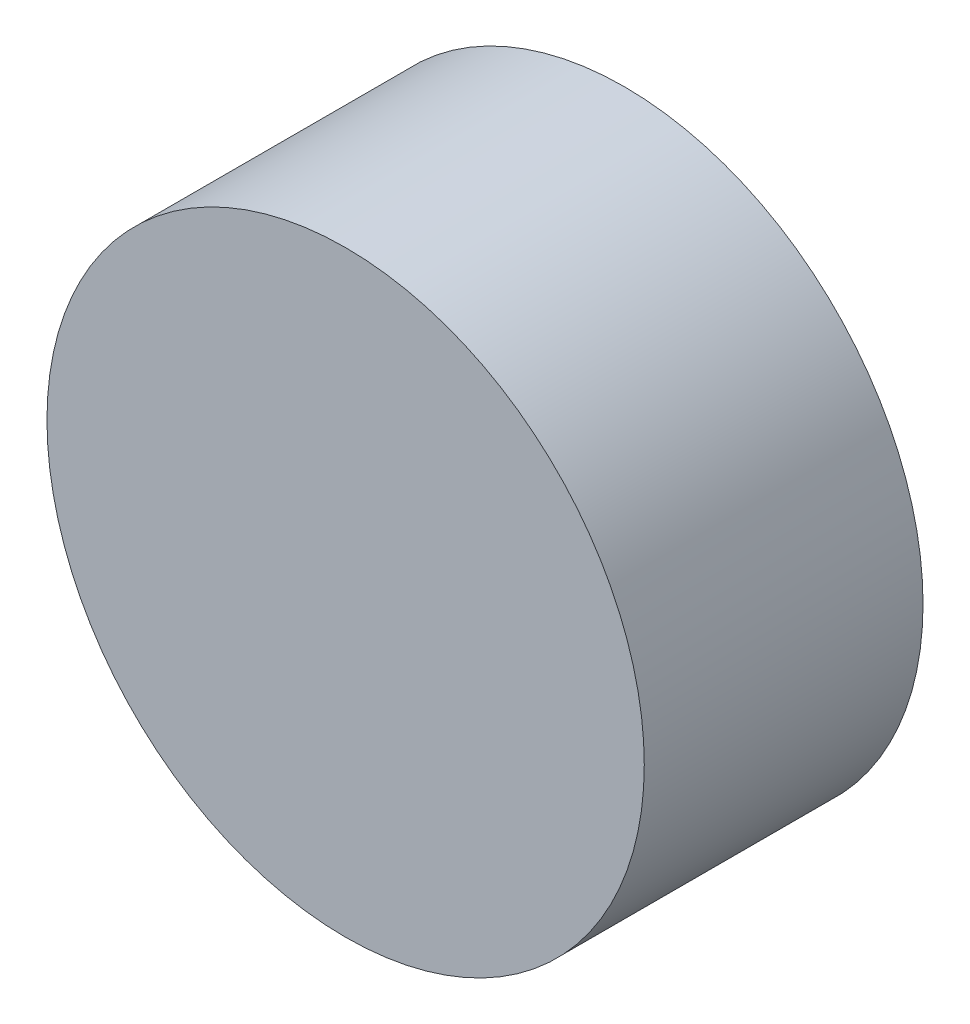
ISO-10303-21;
HEADER;
FILE_DESCRIPTION(('STEP AP214'),'2;1');
FILE_NAME('part.step','',(''),(''),'','','');
FILE_SCHEMA(('AUTOMOTIVE_DESIGN { 1 0 10303 214 1 1 1 1 }'));
ENDSEC;
DATA;
#1=APPLICATION_CONTEXT('core data for automotive mechanical design processes');
#2=APPLICATION_PROTOCOL_DEFINITION('international standard','automotive_design',2000,#1);
#3=PRODUCT_CONTEXT('',#1,'mechanical');
#4=PRODUCT('Part','Part','',(#3));
#5=PRODUCT_RELATED_PRODUCT_CATEGORY('part','',(#4));
#6=PRODUCT_DEFINITION_FORMATION('','',#4);
#7=PRODUCT_DEFINITION_CONTEXT('part definition',#1,'design');
#8=PRODUCT_DEFINITION('design','',#6,#7);
#9=PRODUCT_DEFINITION_SHAPE('','',#8);
#10=(LENGTH_UNIT() NAMED_UNIT(*) SI_UNIT(.MILLI.,.METRE.));
#11=(NAMED_UNIT(*) PLANE_ANGLE_UNIT() SI_UNIT($,.RADIAN.));
#12=(NAMED_UNIT(*) SI_UNIT($,.STERADIAN.) SOLID_ANGLE_UNIT());
#13=UNCERTAINTY_MEASURE_WITH_UNIT(LENGTH_MEASURE(1.E-05),#10,'distance_accuracy_value','');
#14=(GEOMETRIC_REPRESENTATION_CONTEXT(3) GLOBAL_UNCERTAINTY_ASSIGNED_CONTEXT((#13)) GLOBAL_UNIT_ASSIGNED_CONTEXT((#10,
#11,#12)) REPRESENTATION_CONTEXT('',''));
#15=CARTESIAN_POINT('',(0.,0.,0.));
#16=DIRECTION('',(0.,0.,1.));
#17=DIRECTION('',(1.,0.,0.));
#18=AXIS2_PLACEMENT_3D('',#15,#16,#17);
#19=CARTESIAN_POINT('',(0.,0.,28.));
#20=DIRECTION('',(0.,0.,-1.));
#21=DIRECTION('',(-1.,0.,0.));
#22=AXIS2_PLACEMENT_3D('',#19,#20,#21);
#23=CYLINDRICAL_SURFACE('',#22,30.);
#24=CARTESIAN_POINT('',(0.,0.,28.));
#25=DIRECTION('',(0.,0.,1.));
#26=DIRECTION('',(1.,0.,0.));
#27=AXIS2_PLACEMENT_3D('',#24,#25,#26);
#28=CIRCLE('',#27,30.);
#29=CARTESIAN_POINT('',(30.,0.,28.));
#30=VERTEX_POINT('',#29);
#31=EDGE_CURVE('E10',#30,#30,#28,.T.);
#32=ORIENTED_EDGE('',*,*,#31,.F.);
#33=EDGE_LOOP('',(#32));
#34=FACE_BOUND('',#33,.T.);
#35=CARTESIAN_POINT('',(0.,0.,0.));
#36=DIRECTION('',(0.,0.,1.));
#37=DIRECTION('',(1.,0.,0.));
#38=AXIS2_PLACEMENT_3D('',#35,#36,#37);
#39=CIRCLE('',#38,30.);
#40=CARTESIAN_POINT('',(30.,0.,0.));
#41=VERTEX_POINT('',#40);
#42=EDGE_CURVE('E37',#41,#41,#39,.T.);
#43=ORIENTED_EDGE('',*,*,#42,.T.);
#44=EDGE_LOOP('',(#43));
#45=FACE_BOUND('',#44,.T.);
#46=ADVANCED_FACE('F40',(#34,#45),#23,.T.);
#47=CARTESIAN_POINT('',(0.,0.,28.));
#48=DIRECTION('',(0.,0.,1.));
#49=DIRECTION('',(1.,0.,0.));
#50=AXIS2_PLACEMENT_3D('',#47,#48,#49);
#51=PLANE('',#50);
#52=ORIENTED_EDGE('',*,*,#31,.T.);
#53=EDGE_LOOP('',(#52));
#54=FACE_BOUND('',#53,.T.);
#55=ADVANCED_FACE('F55',(#54),#51,.T.);
#56=CARTESIAN_POINT('',(0.,0.,0.));
#57=DIRECTION('',(0.,0.,1.));
#58=DIRECTION('',(1.,0.,0.));
#59=AXIS2_PLACEMENT_3D('',#56,#57,#58);
#60=PLANE('',#59);
#61=ORIENTED_EDGE('',*,*,#42,.F.);
#62=EDGE_LOOP('',(#61));
#63=FACE_BOUND('',#62,.T.);
#64=ADVANCED_FACE('F49',(#63),#60,.F.);
#65=CLOSED_SHELL('',(#46,#55,#64));
#66=MANIFOLD_SOLID_BREP('B2',#65);
#67=ADVANCED_BREP_SHAPE_REPRESENTATION('',(#18,#66),#14);
#68=SHAPE_DEFINITION_REPRESENTATION(#9,#67);
ENDSEC;
END-ISO-10303-21;
